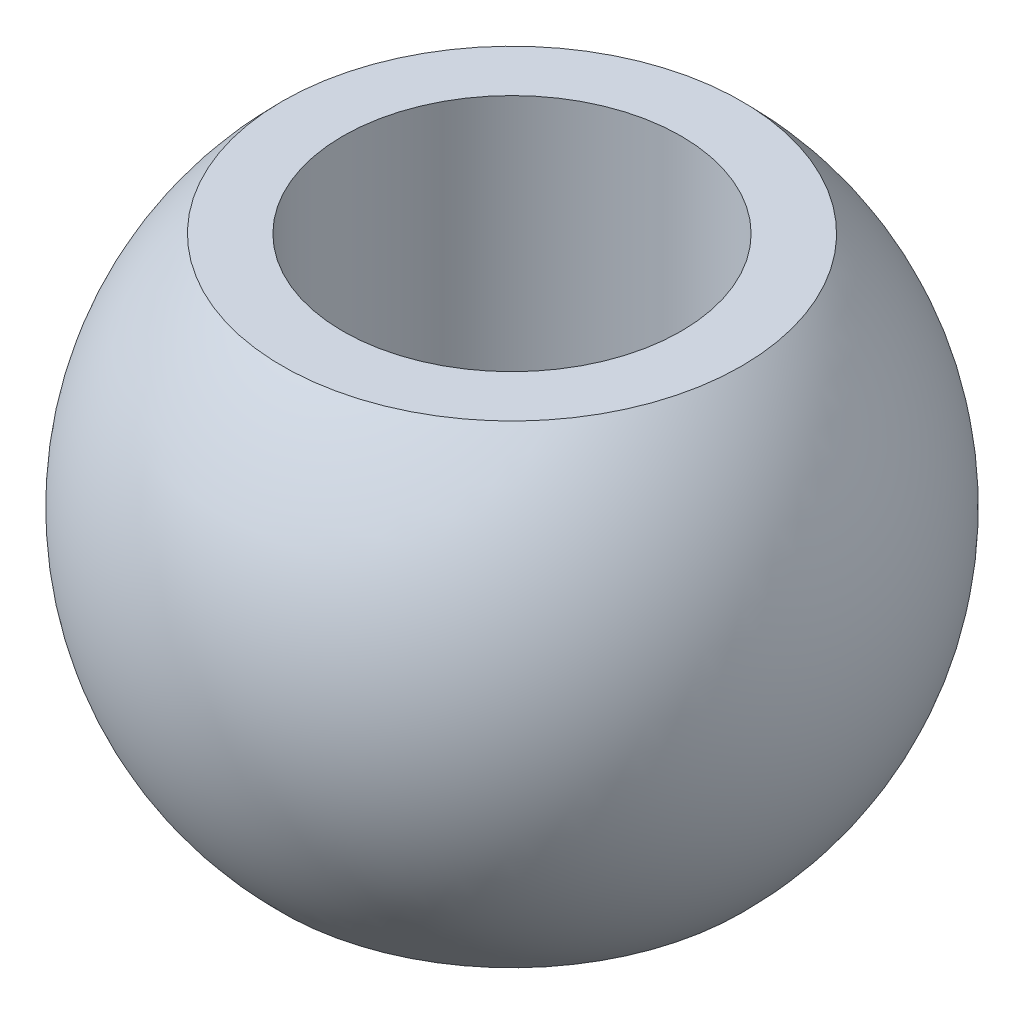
ISO-10303-21;
HEADER;
FILE_DESCRIPTION(('STEP AP214'),'2;1');
FILE_NAME('part.step','',(''),(''),'','','');
FILE_SCHEMA(('AUTOMOTIVE_DESIGN { 1 0 10303 214 1 1 1 1 }'));
ENDSEC;
DATA;
#1=APPLICATION_CONTEXT('core data for automotive mechanical design processes');
#2=APPLICATION_PROTOCOL_DEFINITION('international standard','automotive_design',2000,#1);
#3=PRODUCT_CONTEXT('',#1,'mechanical');
#4=PRODUCT('Part','Part','',(#3));
#5=PRODUCT_RELATED_PRODUCT_CATEGORY('part','',(#4));
#6=PRODUCT_DEFINITION_FORMATION('','',#4);
#7=PRODUCT_DEFINITION_CONTEXT('part definition',#1,'design');
#8=PRODUCT_DEFINITION('design','',#6,#7);
#9=PRODUCT_DEFINITION_SHAPE('','',#8);
#10=(LENGTH_UNIT() NAMED_UNIT(*) SI_UNIT(.MILLI.,.METRE.));
#11=(NAMED_UNIT(*) PLANE_ANGLE_UNIT() SI_UNIT($,.RADIAN.));
#12=(NAMED_UNIT(*) SI_UNIT($,.STERADIAN.) SOLID_ANGLE_UNIT());
#13=UNCERTAINTY_MEASURE_WITH_UNIT(LENGTH_MEASURE(1.E-05),#10,'distance_accuracy_value','');
#14=(GEOMETRIC_REPRESENTATION_CONTEXT(3) GLOBAL_UNCERTAINTY_ASSIGNED_CONTEXT((#13)) GLOBAL_UNIT_ASSIGNED_CONTEXT((#10,
#11,#12)) REPRESENTATION_CONTEXT('',''));
#15=CARTESIAN_POINT('',(0.,0.,0.));
#16=DIRECTION('',(0.,0.,1.));
#17=DIRECTION('',(1.,0.,0.));
#18=AXIS2_PLACEMENT_3D('',#15,#16,#17);
#19=CARTESIAN_POINT('',(5.,7.,0.));
#20=DIRECTION('',(0.,1.,0.));
#21=DIRECTION('',(0.,0.,1.));
#22=AXIS2_PLACEMENT_3D('',#19,#20,#21);
#23=PLANE('',#22);
#24=CARTESIAN_POINT('',(0.,7.,0.));
#25=DIRECTION('',(0.,-1.,0.));
#26=DIRECTION('',(0.,0.,-1.));
#27=AXIS2_PLACEMENT_3D('',#24,#25,#26);
#28=CIRCLE('',#27,5.);
#29=CARTESIAN_POINT('',(0.,7.,-5.));
#30=VERTEX_POINT('',#29);
#31=EDGE_CURVE('E10',#30,#30,#28,.T.);
#32=ORIENTED_EDGE('',*,*,#31,.T.);
#33=EDGE_LOOP('',(#32));
#34=FACE_BOUND('',#33,.T.);
#35=CARTESIAN_POINT('',(0.,7.,0.));
#36=DIRECTION('',(0.,-1.,0.));
#37=DIRECTION('',(0.,0.,-1.));
#38=AXIS2_PLACEMENT_3D('',#35,#36,#37);
#39=CIRCLE('',#38,6.78693598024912);
#40=CARTESIAN_POINT('',(6.78693598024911,7.,0.));
#41=VERTEX_POINT('',#40);
#42=EDGE_CURVE('E40',#41,#41,#39,.T.);
#43=ORIENTED_EDGE('',*,*,#42,.F.);
#44=EDGE_LOOP('',(#43));
#45=FACE_BOUND('',#44,.T.);
#46=ADVANCED_FACE('F26',(#34,#45),#23,.T.);
#47=CARTESIAN_POINT('',(0.,0.,0.));
#48=DIRECTION('',(0.,-1.,0.));
#49=DIRECTION('',(0.,0.,-1.));
#50=AXIS2_PLACEMENT_3D('',#47,#48,#49);
#51=CYLINDRICAL_SURFACE('',#50,5.);
#52=CARTESIAN_POINT('',(0.,-7.,0.));
#53=DIRECTION('',(0.,-1.,0.));
#54=DIRECTION('',(0.,0.,-1.));
#55=AXIS2_PLACEMENT_3D('',#52,#53,#54);
#56=CIRCLE('',#55,5.);
#57=CARTESIAN_POINT('',(0.,-7.,-5.));
#58=VERTEX_POINT('',#57);
#59=EDGE_CURVE('E32',#58,#58,#56,.T.);
#60=ORIENTED_EDGE('',*,*,#59,.T.);
#61=EDGE_LOOP('',(#60));
#62=FACE_BOUND('',#61,.T.);
#63=ORIENTED_EDGE('',*,*,#31,.F.);
#64=EDGE_LOOP('',(#63));
#65=FACE_BOUND('',#64,.T.);
#66=ADVANCED_FACE('F50',(#62,#65),#51,.F.);
#67=CARTESIAN_POINT('',(5.,-7.,0.));
#68=DIRECTION('',(0.,-1.,0.));
#69=DIRECTION('',(0.,0.,-1.));
#70=AXIS2_PLACEMENT_3D('',#67,#68,#69);
#71=PLANE('',#70);
#72=CARTESIAN_POINT('',(0.,-7.,0.));
#73=DIRECTION('',(0.,-1.,0.));
#74=DIRECTION('',(0.,0.,-1.));
#75=AXIS2_PLACEMENT_3D('',#72,#73,#74);
#76=CIRCLE('',#75,6.78693598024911);
#77=CARTESIAN_POINT('',(6.78693598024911,-7.,0.));
#78=VERTEX_POINT('',#77);
#79=EDGE_CURVE('E36',#78,#78,#76,.T.);
#80=ORIENTED_EDGE('',*,*,#79,.T.);
#81=EDGE_LOOP('',(#80));
#82=FACE_BOUND('',#81,.T.);
#83=ORIENTED_EDGE('',*,*,#59,.F.);
#84=EDGE_LOOP('',(#83));
#85=FACE_BOUND('',#84,.T.);
#86=ADVANCED_FACE('F54',(#82,#85),#71,.T.);
#87=CARTESIAN_POINT('',(0.,0.,0.));
#88=DIRECTION('',(0.,-1.,0.));
#89=DIRECTION('',(1.,0.,0.));
#90=AXIS2_PLACEMENT_3D('',#87,#88,#89);
#91=SPHERICAL_SURFACE('',#90,9.75);
#92=CARTESIAN_POINT('',(6.78693598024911,7.,0.));
#93=CARTESIAN_POINT('',(6.90372942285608,6.88676657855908,0.));
#94=CARTESIAN_POINT('',(7.01768372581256,6.770605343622,0.));
#95=CARTESIAN_POINT('',(7.23964037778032,6.53272917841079,0.));
#96=CARTESIAN_POINT('',(7.3476427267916,6.41101424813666,0.));
#97=CARTESIAN_POINT('',(7.55742179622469,6.16233262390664,0.));
#98=CARTESIAN_POINT('',(7.65919851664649,6.03536592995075,0.));
#99=CARTESIAN_POINT('',(7.85627224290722,5.77649959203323,0.));
#100=CARTESIAN_POINT('',(7.95156924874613,5.6445999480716,0.));
#101=CARTESIAN_POINT('',(8.13544461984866,5.37619788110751,0.));
#102=CARTESIAN_POINT('',(8.22402298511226,5.23969545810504,0.));
#103=CARTESIAN_POINT('',(8.39423926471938,4.96242980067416,0.));
#104=CARTESIAN_POINT('',(8.4758771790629,4.82166656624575,0.));
#105=CARTESIAN_POINT('',(8.63200805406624,4.53623185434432,0.));
#106=CARTESIAN_POINT('',(8.70650101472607,4.3915603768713,0.));
#107=CARTESIAN_POINT('',(8.84815539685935,4.09867155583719,0.));
#108=CARTESIAN_POINT('',(8.9153168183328,3.9504542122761,0.));
#109=CARTESIAN_POINT('',(9.04213989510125,3.65084491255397,0.));
#110=CARTESIAN_POINT('',(9.10180155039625,3.49945295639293,0.));
#111=CARTESIAN_POINT('',(9.21347565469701,3.19387363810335,0.));
#112=CARTESIAN_POINT('',(9.26548810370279,3.0396862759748,0.));
#113=CARTESIAN_POINT('',(9.36173351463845,2.7289023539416,0.));
#114=CARTESIAN_POINT('',(9.40596647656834,2.57230579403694,0.));
#115=CARTESIAN_POINT('',(9.48654211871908,2.25709571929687,0.));
#116=CARTESIAN_POINT('',(9.52288479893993,2.09848220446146,0.));
#117=CARTESIAN_POINT('',(9.5875888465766,1.77963551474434,0.));
#118=CARTESIAN_POINT('',(9.61595021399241,1.61940233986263,0.));
#119=CARTESIAN_POINT('',(9.66462059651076,1.29771768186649,0.));
#120=CARTESIAN_POINT('',(9.6849296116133,1.13626619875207,0.));
#121=CARTESIAN_POINT('',(9.7174444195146,0.812549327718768,0.));
#122=CARTESIAN_POINT('',(9.72965021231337,0.6502839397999,0.));
#123=CARTESIAN_POINT('',(9.74592800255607,0.325345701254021,0.));
#124=CARTESIAN_POINT('',(9.75,0.162672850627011,0.));
#125=CARTESIAN_POINT('',(9.75,-0.162672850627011,0.));
#126=CARTESIAN_POINT('',(9.74592800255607,-0.325345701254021,0.));
#127=CARTESIAN_POINT('',(9.72965021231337,-0.6502839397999,0.));
#128=CARTESIAN_POINT('',(9.7174444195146,-0.812549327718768,0.));
#129=CARTESIAN_POINT('',(9.6849296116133,-1.13626619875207,0.));
#130=CARTESIAN_POINT('',(9.66462059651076,-1.29771768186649,0.));
#131=CARTESIAN_POINT('',(9.61595021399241,-1.61940233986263,0.));
#132=CARTESIAN_POINT('',(9.5875888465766,-1.77963551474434,0.));
#133=CARTESIAN_POINT('',(9.52288479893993,-2.09848220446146,0.));
#134=CARTESIAN_POINT('',(9.48654211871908,-2.25709571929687,0.));
#135=CARTESIAN_POINT('',(9.40596647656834,-2.57230579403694,0.));
#136=CARTESIAN_POINT('',(9.36173351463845,-2.7289023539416,0.));
#137=CARTESIAN_POINT('',(9.26548810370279,-3.0396862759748,0.));
#138=CARTESIAN_POINT('',(9.21347565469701,-3.19387363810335,0.));
#139=CARTESIAN_POINT('',(9.10180155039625,-3.49945295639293,0.));
#140=CARTESIAN_POINT('',(9.04213989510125,-3.65084491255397,0.));
#141=CARTESIAN_POINT('',(8.9153168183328,-3.9504542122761,0.));
#142=CARTESIAN_POINT('',(8.84815539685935,-4.09867155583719,0.));
#143=CARTESIAN_POINT('',(8.70650101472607,-4.3915603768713,0.));
#144=CARTESIAN_POINT('',(8.63200805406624,-4.53623185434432,0.));
#145=CARTESIAN_POINT('',(8.4758771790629,-4.82166656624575,0.));
#146=CARTESIAN_POINT('',(8.39423926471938,-4.96242980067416,0.));
#147=CARTESIAN_POINT('',(8.22402298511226,-5.23969545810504,0.));
#148=CARTESIAN_POINT('',(8.13544461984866,-5.37619788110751,0.));
#149=CARTESIAN_POINT('',(7.95156924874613,-5.6445999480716,0.));
#150=CARTESIAN_POINT('',(7.85627224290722,-5.77649959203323,0.));
#151=CARTESIAN_POINT('',(7.65919851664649,-6.03536592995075,0.));
#152=CARTESIAN_POINT('',(7.55742179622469,-6.16233262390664,0.));
#153=CARTESIAN_POINT('',(7.3476427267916,-6.41101424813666,0.));
#154=CARTESIAN_POINT('',(7.23964037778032,-6.53272917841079,0.));
#155=CARTESIAN_POINT('',(7.01768372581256,-6.770605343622,0.));
#156=CARTESIAN_POINT('',(6.90372942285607,-6.88676657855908,0.));
#157=CARTESIAN_POINT('',(6.78693598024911,-7.,0.));
#158=B_SPLINE_CURVE_WITH_KNOTS('',3,(#92,#93,#94,#95,#96,#97,#98,#99,#100,#101,#102,#103,#104,
#105,#106,#107,#108,#109,#110,#111,#112,#113,#114,#115,#116,#117,#118,#119,#120,#121,#122,#123,
#124,#125,#126,#127,#128,#129,#130,#131,#132,#133,#134,#135,#136,#137,#138,#139,#140,#141,#142,
#143,#144,#145,#146,#147,#148,#149,#150,#151,#152,#153,#154,#155,#156,#157),.UNSPECIFIED.,.F.,
.F.,(4,2,2,2,2,2,2,2,2,2,2,2,2,2,2,2,2,2,2,2,2,2,2,2,2,2,2,2,2,2,2,2,4),(0.,0.487967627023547,
0.975935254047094,1.46390288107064,1.95187050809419,2.43983813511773,2.92780576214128,
3.41577338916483,3.90374101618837,4.39170864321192,4.87967627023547,5.36764389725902,
5.85561152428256,6.34357915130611,6.83154677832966,7.3195144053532,7.80748203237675,
8.2954496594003,8.78341728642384,9.27138491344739,9.75935254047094,10.2473201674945,
10.735287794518,11.2232554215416,11.7112230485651,12.1991906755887,12.6871583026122,
13.1751259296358,13.6630935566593,14.1510611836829,14.6390288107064,15.12699643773,
15.6149640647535),.UNSPECIFIED.);
#159=EDGE_CURVE('BSEAM46',#41,#78,#158,.T.);
#160=ORIENTED_EDGE('',*,*,#42,.T.);
#161=ORIENTED_EDGE('',*,*,#79,.F.);
#162=ORIENTED_EDGE('',*,*,#159,.T.);
#163=ORIENTED_EDGE('',*,*,#159,.F.);
#164=EDGE_LOOP('',(#160,#162,#161,#163));
#165=FACE_BOUND('',#164,.T.);
#166=ADVANCED_FACE('F46',(#165),#91,.T.);
#167=CLOSED_SHELL('',(#46,#66,#86,#166));
#168=MANIFOLD_SOLID_BREP('B2',#167);
#169=ADVANCED_BREP_SHAPE_REPRESENTATION('',(#18,#168),#14);
#170=SHAPE_DEFINITION_REPRESENTATION(#9,#169);
ENDSEC;
END-ISO-10303-21;
